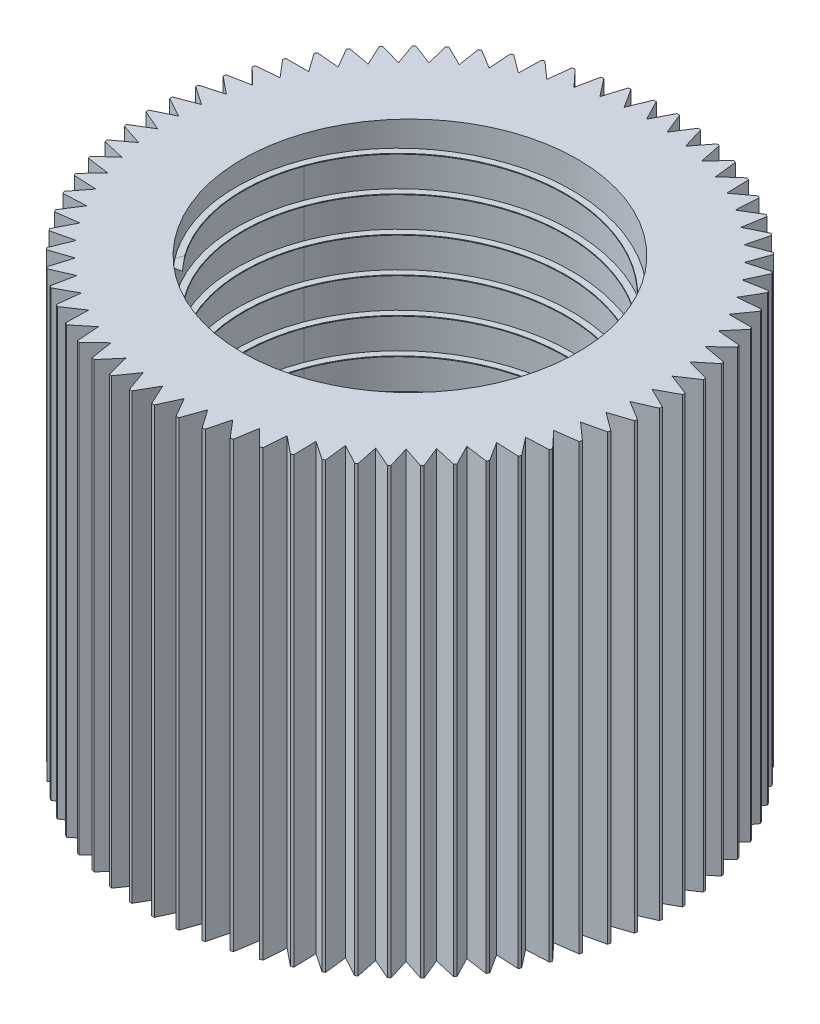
from build123d import *

# Parameters (mm, degrees)
SKETCH1_R           = 3.7211
SKETCH1_R_2         = 2.4257
BOSS_EXTRUDE1_DEPTH = 6.4262
CUT_EXTRUDE1_DEPTH  = 6.4262
CIRPATTERN1_COUNT   = 69
SWEEP1_PITCH        = 0.508
SWEEP1_HEIGHT       = 6.175
SWEEP1_RADIUS       = 2.6797
SWEEP1_START_ANGLE  = -90


with BuildPart() as part:
    # Sketch1 → Boss-Extrude1 (new body)
    with BuildSketch(Plane(origin=(0, 0, 0), x_dir=(1, 0, 0), z_dir=(0, 1, 0))):
        with Locations(Location((0, 0, 0), (0, 0, 270))):
            Circle(SKETCH1_R)
        with Locations(Location((0, 0, 0), (0, 0, 270))):
            Circle(SKETCH1_R_2, mode=Mode.SUBTRACT)
    extrude(amount=BOSS_EXTRUDE1_DEPTH)

    # Sketch3 → Cut-Extrude1 (cut)
    with BuildSketch(Plane(origin=(0, 6.4262, 0), x_dir=(1, 0, 0), z_dir=(0, 1, 0))):
        Polygon((-0.223888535, 3.859940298), (0, 3.427388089), (0.223888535, 3.859940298), align=None)
    cut_extrude1 = extrude(amount=-CUT_EXTRUDE1_DEPTH, mode=Mode.SUBTRACT)

    # CirPattern1: Cut-Extrude1 ×69 about axis
    cirpattern1_axis = Axis((0, 0, 0), (0, 1, 0))
    for i in range(1, CIRPATTERN1_COUNT):
        add(cut_extrude1.rotate(cirpattern1_axis, i * 360 / CIRPATTERN1_COUNT), mode=Mode.SUBTRACT)

    # Sweep1: sweep along a helix
    with BuildLine() as sweep1_path:
        add(Helix(SWEEP1_PITCH, SWEEP1_HEIGHT, SWEEP1_RADIUS, center=(0, 0, 0), direction=(0, 1, 0), mode=Mode.PRIVATE).rotate(Axis((0, 0, 0), (0, 1, 0)), SWEEP1_START_ANGLE))
    # Sketch5 → Sweep1 (sweep)
    with BuildSketch(Plane.XZ):
        Polygon((-2.476792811, -0.727773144), (-2.272533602, -0.523513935), (-2.196451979, -0.787733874), align=None)
    sweep(path=sweep1_path.line, is_frenet=True)


solid = part.part
